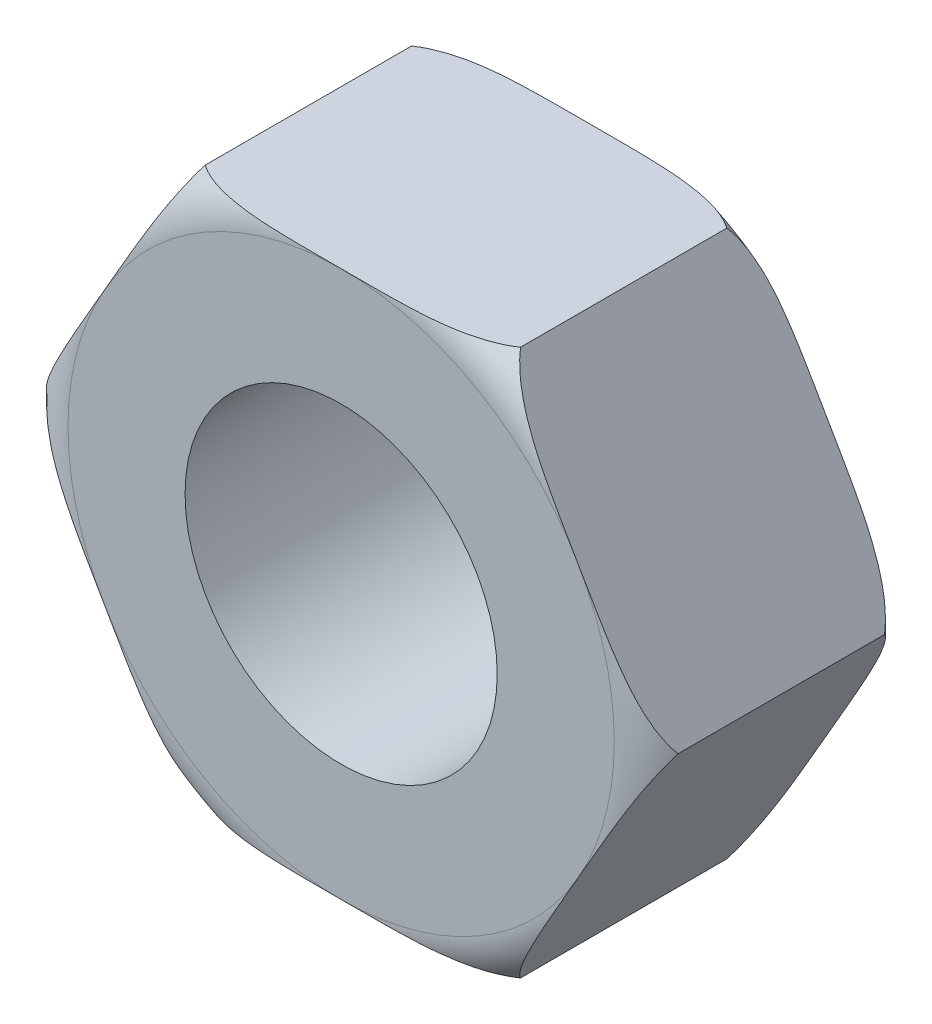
from build123d import *

# Parameters (mm, degrees)
BASE_EXTRUSION_DEPTH    = 3.2
ESQUISSE2_R             = 2
ENL_V_MAT_EXTRU_1_DEPTH = 7.23083729


with BuildPart() as part:
    # Esquisse1 → Base-Extrusion (new body)
    with BuildSketch(Plane.XY):
        Polygon((-4.041451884, 0), (-2.020725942, 3.5), (2.020725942, 3.5), (4.041451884, 0), (2.020725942, -3.5), (-2.020725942, -3.5), align=None)
    extrude(amount=BASE_EXTRUSION_DEPTH)

    # Esquisse2 → Enl_v. mat.-Extru.1 (cut, through all)
    with BuildSketch(Plane.XY.offset(3.2)):
        Circle(ESQUISSE2_R)
    extrude(amount=-ENL_V_MAT_EXTRU_1_DEPTH, mode=Mode.SUBTRACT)

    # Esquisse3 → Enlever de la mati_re-R_volution1 (revolve, cut)
    with BuildSketch(Plane(origin=(0, 0, 0), x_dir=(1, 0, 0), z_dir=(0, 1, 0))):
        with BuildLine():
            Line((-4.041451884, -0.277726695), (-4.041451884, 0))
            Line((-4.041451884, 0), (-3.5, 0))
            ThreePointArc((-3.5, 0), (-3.804262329, -0.0734813), (-4.041451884, -0.277726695))
        make_face()
    enlever_de_la_mati_re_r_volution1 = revolve(axis=Axis((0, 0, 0), (0, 0, 1)), mode=Mode.SUBTRACT)

    # Sym_trie1: Enlever de la mati_re-R_volution1 across plane
    add(enlever_de_la_mati_re_r_volution1.mirror(Plane(origin=(0, 0, 1.6), x_dir=(1, 0, 0), z_dir=(0, 0, -1))), mode=Mode.SUBTRACT)


solid = part.part
